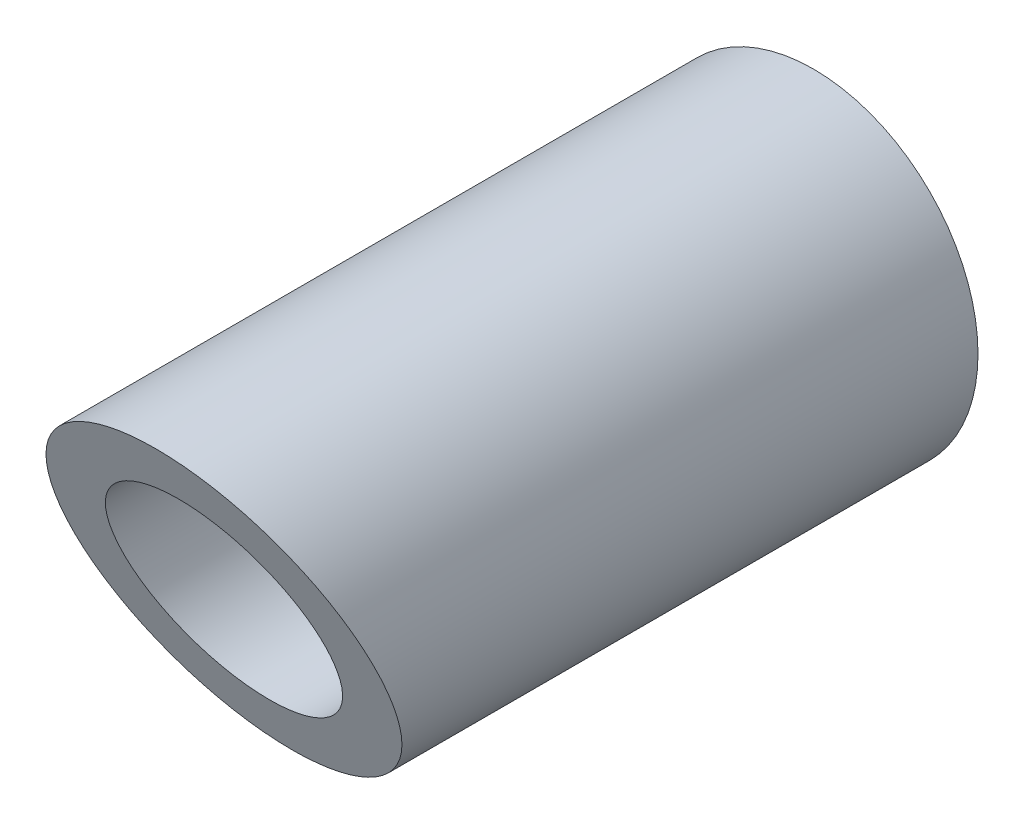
from build123d import *

# Parameters (mm, degrees)
SKIZZE1_R                            = 7.5
SKIZZE1_R_2                          = 5
LINEAR_AUSTRAGEN1_DEPTH              = 30
SCHNITT_LINEAR_AUSTRAGEN1_DEPTH      = 32.819805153
SCHNITT_LINEAR_AUSTRAGEN1_DEPTH_BACK = 32.819805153


with BuildPart() as part:
    # Skizze1 → Linear austragen1 (new body)
    with BuildSketch(Plane.XY):
        Circle(SKIZZE1_R)
        Circle(SKIZZE1_R_2, mode=Mode.SUBTRACT)
    extrude(amount=LINEAR_AUSTRAGEN1_DEPTH)

    # Skizze2 → Schnitt-Linear austragen1 (cut, two sides: drawn at the far end of the back side and taken through both)
    with BuildSketch(Plane(origin=(0, 0, 0), x_dir=(0, 0, -1), z_dir=(1, 0, 0)).offset(-SCHNITT_LINEAR_AUSTRAGEN1_DEPTH_BACK)):
        Polygon((-59.498019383, 78.714518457), (-30, 7.5), (-23.786796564, -7.5), (5.711222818, -78.714518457), (-136.717814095, -137.710557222), (-201.927056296, 19.718479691), align=None)
    extrude(amount=SCHNITT_LINEAR_AUSTRAGEN1_DEPTH + SCHNITT_LINEAR_AUSTRAGEN1_DEPTH_BACK, mode=Mode.SUBTRACT)


solid = part.part
